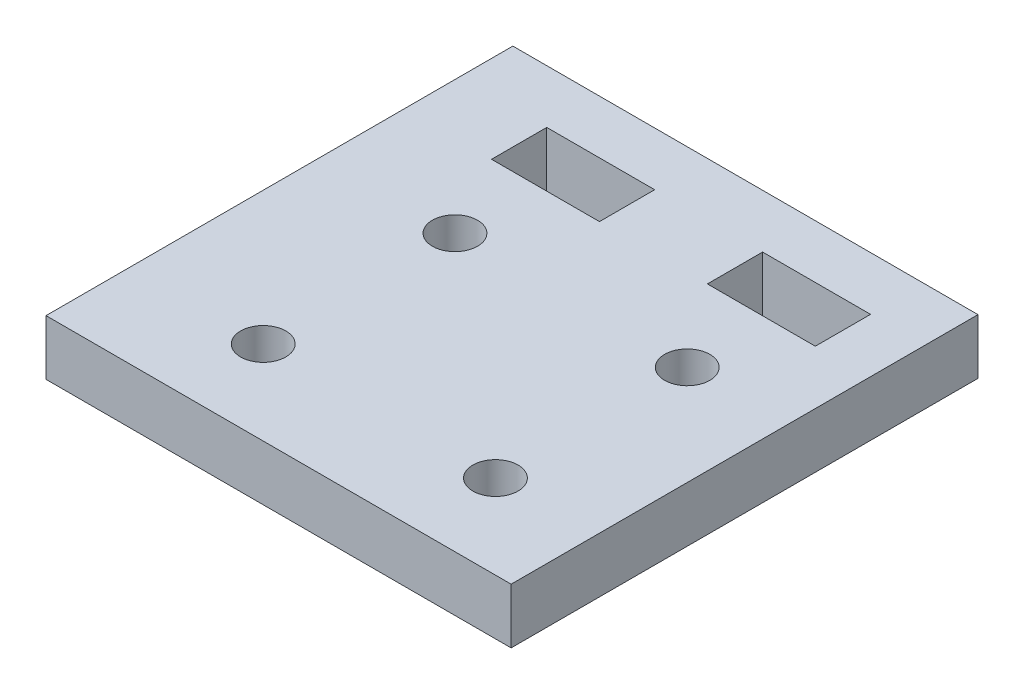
from build123d import *

# Parameters (mm, degrees)
SKETCH1_W           = 46.327817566
SKETCH1_H           = 46.5
SKETCH1_R           = 2.25
SKETCH1_W_2         = 10.75
SKETCH1_H_2         = 5.5
BOSS_EXTRUDE1_DEPTH = 5.5


with BuildPart() as part:
    # Sketch1 → Boss-Extrude1 (new body)
    with BuildSketch(Plane(origin=(0, 0, 0), x_dir=(1, 0, 0), z_dir=(0, 1, 0))):
        with Locations((-23.163908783, 30.577817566)):
            Rectangle(SKETCH1_W, SKETCH1_H)
        with Locations(Location((-33.067297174, 34.799745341, 0), (0, 0, 270))):
            Circle(SKETCH1_R, mode=Mode.SUBTRACT)
        with Locations(Location((-9.932702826, 34.799745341, 0), (0, 0, 270))):
            Circle(SKETCH1_R, mode=Mode.SUBTRACT)
        with Locations(Location((-9.932702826, 15.700254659, 0), (0, 0, 270))):
            Circle(SKETCH1_R, mode=Mode.SUBTRACT)
        with Locations(Location((-33.067297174, 15.700254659, 0), (0, 0, 270))):
            Circle(SKETCH1_R, mode=Mode.SUBTRACT)
        with Locations((-32.25, 45.75)):
            Rectangle(SKETCH1_W_2, SKETCH1_H_2, mode=Mode.SUBTRACT)
        with Locations((-10.75, 45.75)):
            Rectangle(SKETCH1_W_2, SKETCH1_H_2, mode=Mode.SUBTRACT)
    extrude(amount=BOSS_EXTRUDE1_DEPTH)


solid = part.part
